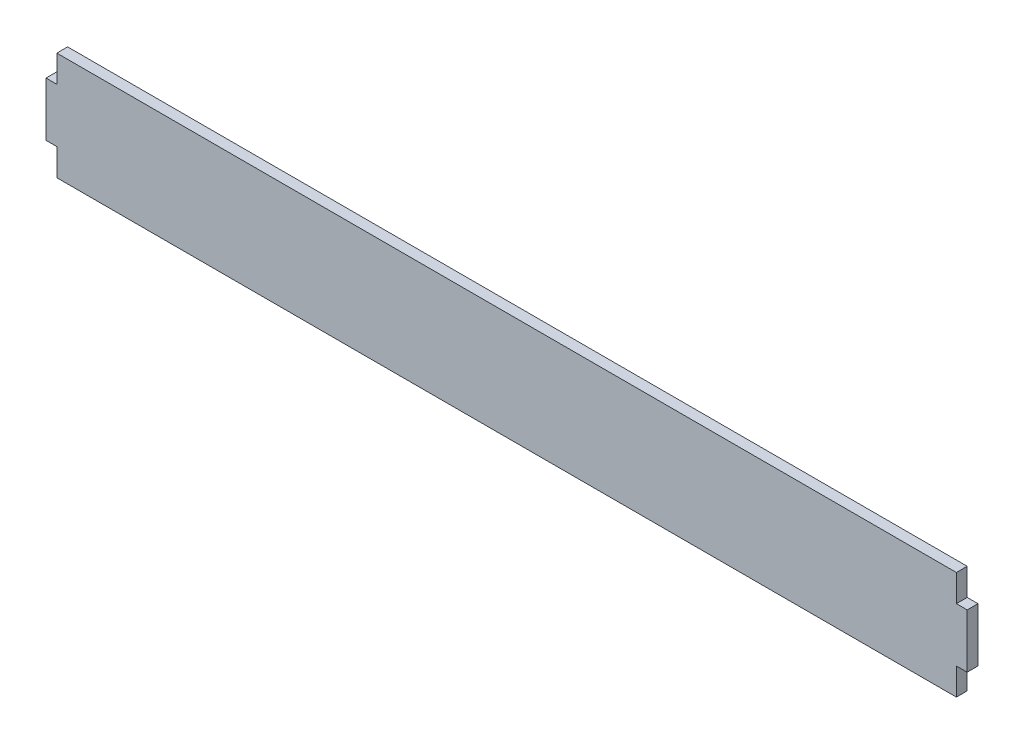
ISO-10303-21;
HEADER;
FILE_DESCRIPTION(('STEP AP214'),'2;1');
FILE_NAME('part.step','',(''),(''),'','','');
FILE_SCHEMA(('AUTOMOTIVE_DESIGN { 1 0 10303 214 1 1 1 1 }'));
ENDSEC;
DATA;
#1=APPLICATION_CONTEXT('core data for automotive mechanical design processes');
#2=APPLICATION_PROTOCOL_DEFINITION('international standard','automotive_design',2000,#1);
#3=PRODUCT_CONTEXT('',#1,'mechanical');
#4=PRODUCT('Part','Part','',(#3));
#5=PRODUCT_RELATED_PRODUCT_CATEGORY('part','',(#4));
#6=PRODUCT_DEFINITION_FORMATION('','',#4);
#7=PRODUCT_DEFINITION_CONTEXT('part definition',#1,'design');
#8=PRODUCT_DEFINITION('design','',#6,#7);
#9=PRODUCT_DEFINITION_SHAPE('','',#8);
#10=(LENGTH_UNIT() NAMED_UNIT(*) SI_UNIT(.MILLI.,.METRE.));
#11=(NAMED_UNIT(*) PLANE_ANGLE_UNIT() SI_UNIT($,.RADIAN.));
#12=(NAMED_UNIT(*) SI_UNIT($,.STERADIAN.) SOLID_ANGLE_UNIT());
#13=UNCERTAINTY_MEASURE_WITH_UNIT(LENGTH_MEASURE(1.E-05),#10,'distance_accuracy_value','');
#14=(GEOMETRIC_REPRESENTATION_CONTEXT(3) GLOBAL_UNCERTAINTY_ASSIGNED_CONTEXT((#13)) GLOBAL_UNIT_ASSIGNED_CONTEXT((#10,
#11,#12)) REPRESENTATION_CONTEXT('',''));
#15=CARTESIAN_POINT('',(0.,0.,0.));
#16=DIRECTION('',(0.,0.,1.));
#17=DIRECTION('',(1.,0.,0.));
#18=AXIS2_PLACEMENT_3D('',#15,#16,#17);
#19=CARTESIAN_POINT('',(500.,29.9999999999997,12.));
#20=DIRECTION('',(-1.,0.,0.));
#21=DIRECTION('',(0.,0.,1.));
#22=AXIS2_PLACEMENT_3D('',#19,#20,#21);
#23=PLANE('',#22);
#24=DIRECTION('',(0.,1.,0.));
#25=VECTOR('',#24,1.);
#26=CARTESIAN_POINT('',(500.,29.9999999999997,0.));
#27=LINE('',#26,#25);
#28=CARTESIAN_POINT('',(500.,29.9999999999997,0.));
#29=VERTEX_POINT('',#28);
#30=CARTESIAN_POINT('',(500.,60.0000000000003,0.));
#31=VERTEX_POINT('',#30);
#32=EDGE_CURVE('E161',#29,#31,#27,.T.);
#33=ORIENTED_EDGE('',*,*,#32,.T.);
#34=DIRECTION('',(0.,0.,-1.));
#35=VECTOR('',#34,1.);
#36=CARTESIAN_POINT('',(500.,60.0000000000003,12.));
#37=LINE('',#36,#35);
#38=CARTESIAN_POINT('',(500.,60.0000000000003,12.));
#39=VERTEX_POINT('',#38);
#40=EDGE_CURVE('E11',#39,#31,#37,.T.);
#41=ORIENTED_EDGE('',*,*,#40,.F.);
#42=DIRECTION('',(0.,1.,0.));
#43=VECTOR('',#42,1.);
#44=CARTESIAN_POINT('',(500.,29.9999999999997,12.));
#45=LINE('',#44,#43);
#46=CARTESIAN_POINT('',(500.,29.9999999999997,12.));
#47=VERTEX_POINT('',#46);
#48=EDGE_CURVE('E183',#47,#39,#45,.T.);
#49=ORIENTED_EDGE('',*,*,#48,.F.);
#50=DIRECTION('',(0.,0.,-1.));
#51=VECTOR('',#50,1.);
#52=CARTESIAN_POINT('',(500.,29.9999999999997,12.));
#53=LINE('',#52,#51);
#54=EDGE_CURVE('E157',#47,#29,#53,.T.);
#55=ORIENTED_EDGE('',*,*,#54,.T.);
#56=EDGE_LOOP('',(#33,#41,#49,#55));
#57=FACE_BOUND('',#56,.T.);
#58=ADVANCED_FACE('F41',(#57),#23,.F.);
#59=CARTESIAN_POINT('',(-500.,60.0000000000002,12.));
#60=DIRECTION('',(0.,-1.,0.));
#61=DIRECTION('',(1.,0.,0.));
#62=AXIS2_PLACEMENT_3D('',#59,#60,#61);
#63=PLANE('',#62);
#64=DIRECTION('',(-1.,0.,0.));
#65=VECTOR('',#64,1.);
#66=CARTESIAN_POINT('',(-500.,60.0000000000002,0.));
#67=LINE('',#66,#65);
#68=CARTESIAN_POINT('',(-500.,60.0000000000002,0.));
#69=VERTEX_POINT('',#68);
#70=EDGE_CURVE('E164',#31,#69,#67,.T.);
#71=ORIENTED_EDGE('',*,*,#70,.T.);
#72=DIRECTION('',(0.,0.,-1.));
#73=VECTOR('',#72,1.);
#74=CARTESIAN_POINT('',(-500.,60.0000000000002,12.));
#75=LINE('',#74,#73);
#76=CARTESIAN_POINT('',(-500.,60.0000000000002,12.));
#77=VERTEX_POINT('',#76);
#78=EDGE_CURVE('E49',#77,#69,#75,.T.);
#79=ORIENTED_EDGE('',*,*,#78,.F.);
#80=DIRECTION('',(-1.,0.,0.));
#81=VECTOR('',#80,1.);
#82=CARTESIAN_POINT('',(-500.,60.0000000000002,12.));
#83=LINE('',#82,#81);
#84=EDGE_CURVE('E112',#39,#77,#83,.T.);
#85=ORIENTED_EDGE('',*,*,#84,.F.);
#86=ORIENTED_EDGE('',*,*,#40,.T.);
#87=EDGE_LOOP('',(#71,#79,#85,#86));
#88=FACE_BOUND('',#87,.T.);
#89=ADVANCED_FACE('F261',(#88),#63,.F.);
#90=CARTESIAN_POINT('',(-500.,29.9999999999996,12.));
#91=DIRECTION('',(1.,0.,0.));
#92=DIRECTION('',(0.,0.,-1.));
#93=AXIS2_PLACEMENT_3D('',#90,#91,#92);
#94=PLANE('',#93);
#95=DIRECTION('',(0.,-1.,0.));
#96=VECTOR('',#95,1.);
#97=CARTESIAN_POINT('',(-500.,29.9999999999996,0.));
#98=LINE('',#97,#96);
#99=CARTESIAN_POINT('',(-500.,29.9999999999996,0.));
#100=VERTEX_POINT('',#99);
#101=EDGE_CURVE('E166',#69,#100,#98,.T.);
#102=ORIENTED_EDGE('',*,*,#101,.T.);
#103=DIRECTION('',(0.,0.,-1.));
#104=VECTOR('',#103,1.);
#105=CARTESIAN_POINT('',(-500.,29.9999999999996,12.));
#106=LINE('',#105,#104);
#107=CARTESIAN_POINT('',(-500.,29.9999999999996,12.));
#108=VERTEX_POINT('',#107);
#109=EDGE_CURVE('E202',#108,#100,#106,.T.);
#110=ORIENTED_EDGE('',*,*,#109,.F.);
#111=DIRECTION('',(0.,-1.,0.));
#112=VECTOR('',#111,1.);
#113=CARTESIAN_POINT('',(-500.,29.9999999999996,12.));
#114=LINE('',#113,#112);
#115=EDGE_CURVE('E210',#77,#108,#114,.T.);
#116=ORIENTED_EDGE('',*,*,#115,.F.);
#117=ORIENTED_EDGE('',*,*,#78,.T.);
#118=EDGE_LOOP('',(#102,#110,#116,#117));
#119=FACE_BOUND('',#118,.T.);
#120=ADVANCED_FACE('F208',(#119),#94,.F.);
#121=CARTESIAN_POINT('',(-500.,29.9999999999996,12.));
#122=DIRECTION('',(0.,-1.,0.));
#123=DIRECTION('',(1.,0.,0.));
#124=AXIS2_PLACEMENT_3D('',#121,#122,#123);
#125=PLANE('',#124);
#126=DIRECTION('',(-1.,0.,0.));
#127=VECTOR('',#126,1.);
#128=CARTESIAN_POINT('',(-500.,29.9999999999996,0.));
#129=LINE('',#128,#127);
#130=CARTESIAN_POINT('',(-512.,29.9999999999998,0.));
#131=VERTEX_POINT('',#130);
#132=EDGE_CURVE('E168',#100,#131,#129,.T.);
#133=ORIENTED_EDGE('',*,*,#132,.T.);
#134=DIRECTION('',(0.,0.,-1.));
#135=VECTOR('',#134,1.);
#136=CARTESIAN_POINT('',(-512.,29.9999999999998,12.));
#137=LINE('',#136,#135);
#138=CARTESIAN_POINT('',(-512.,29.9999999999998,12.));
#139=VERTEX_POINT('',#138);
#140=EDGE_CURVE('E199',#139,#131,#137,.T.);
#141=ORIENTED_EDGE('',*,*,#140,.F.);
#142=DIRECTION('',(-1.,0.,0.));
#143=VECTOR('',#142,1.);
#144=CARTESIAN_POINT('',(-500.,29.9999999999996,12.));
#145=LINE('',#144,#143);
#146=EDGE_CURVE('E228',#108,#139,#145,.T.);
#147=ORIENTED_EDGE('',*,*,#146,.F.);
#148=ORIENTED_EDGE('',*,*,#109,.T.);
#149=EDGE_LOOP('',(#133,#141,#147,#148));
#150=FACE_BOUND('',#149,.T.);
#151=ADVANCED_FACE('F219',(#150),#125,.F.);
#152=CARTESIAN_POINT('',(-512.,29.9999999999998,12.));
#153=DIRECTION('',(1.,0.,0.));
#154=DIRECTION('',(0.,0.,-1.));
#155=AXIS2_PLACEMENT_3D('',#152,#153,#154);
#156=PLANE('',#155);
#157=DIRECTION('',(0.,-1.,0.));
#158=VECTOR('',#157,1.);
#159=CARTESIAN_POINT('',(-512.,29.9999999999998,0.));
#160=LINE('',#159,#158);
#161=CARTESIAN_POINT('',(-512.,-29.9999999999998,0.));
#162=VERTEX_POINT('',#161);
#163=EDGE_CURVE('E170',#131,#162,#160,.T.);
#164=ORIENTED_EDGE('',*,*,#163,.T.);
#165=DIRECTION('',(0.,0.,-1.));
#166=VECTOR('',#165,1.);
#167=CARTESIAN_POINT('',(-512.,-29.9999999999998,12.));
#168=LINE('',#167,#166);
#169=CARTESIAN_POINT('',(-512.,-29.9999999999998,12.));
#170=VERTEX_POINT('',#169);
#171=EDGE_CURVE('E196',#170,#162,#168,.T.);
#172=ORIENTED_EDGE('',*,*,#171,.F.);
#173=DIRECTION('',(0.,-1.,0.));
#174=VECTOR('',#173,1.);
#175=CARTESIAN_POINT('',(-512.,29.9999999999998,12.));
#176=LINE('',#175,#174);
#177=EDGE_CURVE('E225',#139,#170,#176,.T.);
#178=ORIENTED_EDGE('',*,*,#177,.F.);
#179=ORIENTED_EDGE('',*,*,#140,.T.);
#180=EDGE_LOOP('',(#164,#172,#178,#179));
#181=FACE_BOUND('',#180,.T.);
#182=ADVANCED_FACE('F223',(#181),#156,.F.);
#183=CARTESIAN_POINT('',(-512.,-29.9999999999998,12.));
#184=DIRECTION('',(0.,1.,0.));
#185=DIRECTION('',(0.,0.,1.));
#186=AXIS2_PLACEMENT_3D('',#183,#184,#185);
#187=PLANE('',#186);
#188=DIRECTION('',(1.,0.,0.));
#189=VECTOR('',#188,1.);
#190=CARTESIAN_POINT('',(-512.,-29.9999999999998,0.));
#191=LINE('',#190,#189);
#192=CARTESIAN_POINT('',(-500.,-29.9999999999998,0.));
#193=VERTEX_POINT('',#192);
#194=EDGE_CURVE('E172',#162,#193,#191,.T.);
#195=ORIENTED_EDGE('',*,*,#194,.T.);
#196=DIRECTION('',(0.,0.,-1.));
#197=VECTOR('',#196,1.);
#198=CARTESIAN_POINT('',(-500.,-29.9999999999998,12.));
#199=LINE('',#198,#197);
#200=CARTESIAN_POINT('',(-500.,-29.9999999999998,12.));
#201=VERTEX_POINT('',#200);
#202=EDGE_CURVE('E193',#201,#193,#199,.T.);
#203=ORIENTED_EDGE('',*,*,#202,.F.);
#204=DIRECTION('',(1.,0.,0.));
#205=VECTOR('',#204,1.);
#206=CARTESIAN_POINT('',(-512.,-29.9999999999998,12.));
#207=LINE('',#206,#205);
#208=EDGE_CURVE('E227',#170,#201,#207,.T.);
#209=ORIENTED_EDGE('',*,*,#208,.F.);
#210=ORIENTED_EDGE('',*,*,#171,.T.);
#211=EDGE_LOOP('',(#195,#203,#209,#210));
#212=FACE_BOUND('',#211,.T.);
#213=ADVANCED_FACE('F274',(#212),#187,.F.);
#214=CARTESIAN_POINT('',(-500.,-60.0000000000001,12.));
#215=DIRECTION('',(1.,0.,0.));
#216=DIRECTION('',(0.,0.,-1.));
#217=AXIS2_PLACEMENT_3D('',#214,#215,#216);
#218=PLANE('',#217);
#219=DIRECTION('',(0.,-1.,0.));
#220=VECTOR('',#219,1.);
#221=CARTESIAN_POINT('',(-500.,-60.0000000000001,0.));
#222=LINE('',#221,#220);
#223=CARTESIAN_POINT('',(-500.,-60.0000000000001,0.));
#224=VERTEX_POINT('',#223);
#225=EDGE_CURVE('E174',#193,#224,#222,.T.);
#226=ORIENTED_EDGE('',*,*,#225,.T.);
#227=DIRECTION('',(0.,0.,-1.));
#228=VECTOR('',#227,1.);
#229=CARTESIAN_POINT('',(-500.,-60.0000000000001,12.));
#230=LINE('',#229,#228);
#231=CARTESIAN_POINT('',(-500.,-60.0000000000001,12.));
#232=VERTEX_POINT('',#231);
#233=EDGE_CURVE('E190',#232,#224,#230,.T.);
#234=ORIENTED_EDGE('',*,*,#233,.F.);
#235=DIRECTION('',(0.,-1.,0.));
#236=VECTOR('',#235,1.);
#237=CARTESIAN_POINT('',(-500.,-60.0000000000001,12.));
#238=LINE('',#237,#236);
#239=EDGE_CURVE('E230',#201,#232,#238,.T.);
#240=ORIENTED_EDGE('',*,*,#239,.F.);
#241=ORIENTED_EDGE('',*,*,#202,.T.);
#242=EDGE_LOOP('',(#226,#234,#240,#241));
#243=FACE_BOUND('',#242,.T.);
#244=ADVANCED_FACE('F277',(#243),#218,.F.);
#245=CARTESIAN_POINT('',(-500.,-60.0000000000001,12.));
#246=DIRECTION('',(0.,1.,0.));
#247=DIRECTION('',(-1.,0.,0.));
#248=AXIS2_PLACEMENT_3D('',#245,#246,#247);
#249=PLANE('',#248);
#250=DIRECTION('',(1.,0.,0.));
#251=VECTOR('',#250,1.);
#252=CARTESIAN_POINT('',(-500.,-60.0000000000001,0.));
#253=LINE('',#252,#251);
#254=CARTESIAN_POINT('',(500.,-60.,0.));
#255=VERTEX_POINT('',#254);
#256=EDGE_CURVE('E176',#224,#255,#253,.T.);
#257=ORIENTED_EDGE('',*,*,#256,.T.);
#258=DIRECTION('',(0.,0.,-1.));
#259=VECTOR('',#258,1.);
#260=CARTESIAN_POINT('',(500.,-60.,12.));
#261=LINE('',#260,#259);
#262=CARTESIAN_POINT('',(500.,-60.,12.));
#263=VERTEX_POINT('',#262);
#264=EDGE_CURVE('E187',#263,#255,#261,.T.);
#265=ORIENTED_EDGE('',*,*,#264,.F.);
#266=DIRECTION('',(1.,0.,0.));
#267=VECTOR('',#266,1.);
#268=CARTESIAN_POINT('',(-500.,-60.0000000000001,12.));
#269=LINE('',#268,#267);
#270=EDGE_CURVE('E236',#232,#263,#269,.T.);
#271=ORIENTED_EDGE('',*,*,#270,.F.);
#272=ORIENTED_EDGE('',*,*,#233,.T.);
#273=EDGE_LOOP('',(#257,#265,#271,#272));
#274=FACE_BOUND('',#273,.T.);
#275=ADVANCED_FACE('F242',(#274),#249,.F.);
#276=CARTESIAN_POINT('',(500.,-60.,12.));
#277=DIRECTION('',(-1.,0.,0.));
#278=DIRECTION('',(0.,0.,1.));
#279=AXIS2_PLACEMENT_3D('',#276,#277,#278);
#280=PLANE('',#279);
#281=DIRECTION('',(0.,1.,0.));
#282=VECTOR('',#281,1.);
#283=CARTESIAN_POINT('',(500.,-60.,0.));
#284=LINE('',#283,#282);
#285=CARTESIAN_POINT('',(500.,-29.9999999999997,0.));
#286=VERTEX_POINT('',#285);
#287=EDGE_CURVE('E178',#255,#286,#284,.T.);
#288=ORIENTED_EDGE('',*,*,#287,.T.);
#289=DIRECTION('',(0.,0.,-1.));
#290=VECTOR('',#289,1.);
#291=CARTESIAN_POINT('',(500.,-29.9999999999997,12.));
#292=LINE('',#291,#290);
#293=CARTESIAN_POINT('',(500.,-29.9999999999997,12.));
#294=VERTEX_POINT('',#293);
#295=EDGE_CURVE('E152',#294,#286,#292,.T.);
#296=ORIENTED_EDGE('',*,*,#295,.F.);
#297=DIRECTION('',(0.,1.,0.));
#298=VECTOR('',#297,1.);
#299=CARTESIAN_POINT('',(500.,-60.,12.));
#300=LINE('',#299,#298);
#301=EDGE_CURVE('E143',#263,#294,#300,.T.);
#302=ORIENTED_EDGE('',*,*,#301,.F.);
#303=ORIENTED_EDGE('',*,*,#264,.T.);
#304=EDGE_LOOP('',(#288,#296,#302,#303));
#305=FACE_BOUND('',#304,.T.);
#306=ADVANCED_FACE('F246',(#305),#280,.F.);
#307=CARTESIAN_POINT('',(512.,-29.9999999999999,12.));
#308=DIRECTION('',(0.,1.,0.));
#309=DIRECTION('',(-1.,0.,0.));
#310=AXIS2_PLACEMENT_3D('',#307,#308,#309);
#311=PLANE('',#310);
#312=DIRECTION('',(1.,0.,0.));
#313=VECTOR('',#312,1.);
#314=CARTESIAN_POINT('',(512.,-29.9999999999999,0.));
#315=LINE('',#314,#313);
#316=CARTESIAN_POINT('',(512.,-29.9999999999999,0.));
#317=VERTEX_POINT('',#316);
#318=EDGE_CURVE('E151',#286,#317,#315,.T.);
#319=ORIENTED_EDGE('',*,*,#318,.T.);
#320=DIRECTION('',(0.,0.,-1.));
#321=VECTOR('',#320,1.);
#322=CARTESIAN_POINT('',(512.,-29.9999999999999,12.));
#323=LINE('',#322,#321);
#324=CARTESIAN_POINT('',(512.,-29.9999999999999,12.));
#325=VERTEX_POINT('',#324);
#326=EDGE_CURVE('E148',#325,#317,#323,.T.);
#327=ORIENTED_EDGE('',*,*,#326,.F.);
#328=DIRECTION('',(1.,0.,0.));
#329=VECTOR('',#328,1.);
#330=CARTESIAN_POINT('',(512.,-29.9999999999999,12.));
#331=LINE('',#330,#329);
#332=EDGE_CURVE('E137',#294,#325,#331,.T.);
#333=ORIENTED_EDGE('',*,*,#332,.F.);
#334=ORIENTED_EDGE('',*,*,#295,.T.);
#335=EDGE_LOOP('',(#319,#327,#333,#334));
#336=FACE_BOUND('',#335,.T.);
#337=ADVANCED_FACE('F149',(#336),#311,.F.);
#338=CARTESIAN_POINT('',(512.,29.9999999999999,12.));
#339=DIRECTION('',(-1.,0.,0.));
#340=DIRECTION('',(0.,0.,1.));
#341=AXIS2_PLACEMENT_3D('',#338,#339,#340);
#342=PLANE('',#341);
#343=DIRECTION('',(0.,1.,0.));
#344=VECTOR('',#343,1.);
#345=CARTESIAN_POINT('',(512.,29.9999999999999,0.));
#346=LINE('',#345,#344);
#347=CARTESIAN_POINT('',(512.,29.9999999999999,0.));
#348=VERTEX_POINT('',#347);
#349=EDGE_CURVE('E98',#317,#348,#346,.T.);
#350=ORIENTED_EDGE('',*,*,#349,.T.);
#351=DIRECTION('',(0.,0.,-1.));
#352=VECTOR('',#351,1.);
#353=CARTESIAN_POINT('',(512.,29.9999999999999,12.));
#354=LINE('',#353,#352);
#355=CARTESIAN_POINT('',(512.,29.9999999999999,12.));
#356=VERTEX_POINT('',#355);
#357=EDGE_CURVE('E153',#356,#348,#354,.T.);
#358=ORIENTED_EDGE('',*,*,#357,.F.);
#359=DIRECTION('',(0.,1.,0.));
#360=VECTOR('',#359,1.);
#361=CARTESIAN_POINT('',(512.,29.9999999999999,12.));
#362=LINE('',#361,#360);
#363=EDGE_CURVE('E141',#325,#356,#362,.T.);
#364=ORIENTED_EDGE('',*,*,#363,.F.);
#365=ORIENTED_EDGE('',*,*,#326,.T.);
#366=EDGE_LOOP('',(#350,#358,#364,#365));
#367=FACE_BOUND('',#366,.T.);
#368=ADVANCED_FACE('F155',(#367),#342,.F.);
#369=CARTESIAN_POINT('',(500.,29.9999999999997,12.));
#370=DIRECTION('',(0.,-1.,0.));
#371=DIRECTION('',(1.,0.,0.));
#372=AXIS2_PLACEMENT_3D('',#369,#370,#371);
#373=PLANE('',#372);
#374=DIRECTION('',(-1.,0.,0.));
#375=VECTOR('',#374,1.);
#376=CARTESIAN_POINT('',(500.,29.9999999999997,0.));
#377=LINE('',#376,#375);
#378=EDGE_CURVE('E104',#348,#29,#377,.T.);
#379=ORIENTED_EDGE('',*,*,#378,.T.);
#380=ORIENTED_EDGE('',*,*,#54,.F.);
#381=DIRECTION('',(-1.,0.,0.));
#382=VECTOR('',#381,1.);
#383=CARTESIAN_POINT('',(500.,29.9999999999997,12.));
#384=LINE('',#383,#382);
#385=EDGE_CURVE('E57',#356,#47,#384,.T.);
#386=ORIENTED_EDGE('',*,*,#385,.F.);
#387=ORIENTED_EDGE('',*,*,#357,.T.);
#388=EDGE_LOOP('',(#379,#380,#386,#387));
#389=FACE_BOUND('',#388,.T.);
#390=ADVANCED_FACE('F250',(#389),#373,.F.);
#391=CARTESIAN_POINT('',(0.,0.,12.));
#392=DIRECTION('',(0.,0.,-1.));
#393=DIRECTION('',(-1.,0.,0.));
#394=AXIS2_PLACEMENT_3D('',#391,#392,#393);
#395=PLANE('',#394);
#396=ORIENTED_EDGE('',*,*,#48,.T.);
#397=ORIENTED_EDGE('',*,*,#84,.T.);
#398=ORIENTED_EDGE('',*,*,#115,.T.);
#399=ORIENTED_EDGE('',*,*,#146,.T.);
#400=ORIENTED_EDGE('',*,*,#177,.T.);
#401=ORIENTED_EDGE('',*,*,#208,.T.);
#402=ORIENTED_EDGE('',*,*,#239,.T.);
#403=ORIENTED_EDGE('',*,*,#270,.T.);
#404=ORIENTED_EDGE('',*,*,#301,.T.);
#405=ORIENTED_EDGE('',*,*,#332,.T.);
#406=ORIENTED_EDGE('',*,*,#363,.T.);
#407=ORIENTED_EDGE('',*,*,#385,.T.);
#408=EDGE_LOOP('',(#396,#397,#398,#399,#400,#401,#402,#403,#404,#405,#406,#407));
#409=FACE_BOUND('',#408,.T.);
#410=ADVANCED_FACE('F139',(#409),#395,.F.);
#411=CARTESIAN_POINT('',(0.,0.,0.));
#412=DIRECTION('',(0.,0.,-1.));
#413=DIRECTION('',(-1.,0.,0.));
#414=AXIS2_PLACEMENT_3D('',#411,#412,#413);
#415=PLANE('',#414);
#416=ORIENTED_EDGE('',*,*,#32,.F.);
#417=ORIENTED_EDGE('',*,*,#378,.F.);
#418=ORIENTED_EDGE('',*,*,#349,.F.);
#419=ORIENTED_EDGE('',*,*,#318,.F.);
#420=ORIENTED_EDGE('',*,*,#287,.F.);
#421=ORIENTED_EDGE('',*,*,#256,.F.);
#422=ORIENTED_EDGE('',*,*,#225,.F.);
#423=ORIENTED_EDGE('',*,*,#194,.F.);
#424=ORIENTED_EDGE('',*,*,#163,.F.);
#425=ORIENTED_EDGE('',*,*,#132,.F.);
#426=ORIENTED_EDGE('',*,*,#101,.F.);
#427=ORIENTED_EDGE('',*,*,#70,.F.);
#428=EDGE_LOOP('',(#416,#417,#418,#419,#420,#421,#422,#423,#424,#425,#426,#427));
#429=FACE_BOUND('',#428,.T.);
#430=ADVANCED_FACE('F214',(#429),#415,.T.);
#431=CLOSED_SHELL('',(#58,#89,#120,#151,#182,#213,#244,#275,#306,#337,#368,#390,#410,#430));
#432=MANIFOLD_SOLID_BREP('B2',#431);
#433=ADVANCED_BREP_SHAPE_REPRESENTATION('',(#18,#432),#14);
#434=SHAPE_DEFINITION_REPRESENTATION(#9,#433);
ENDSEC;
END-ISO-10303-21;
